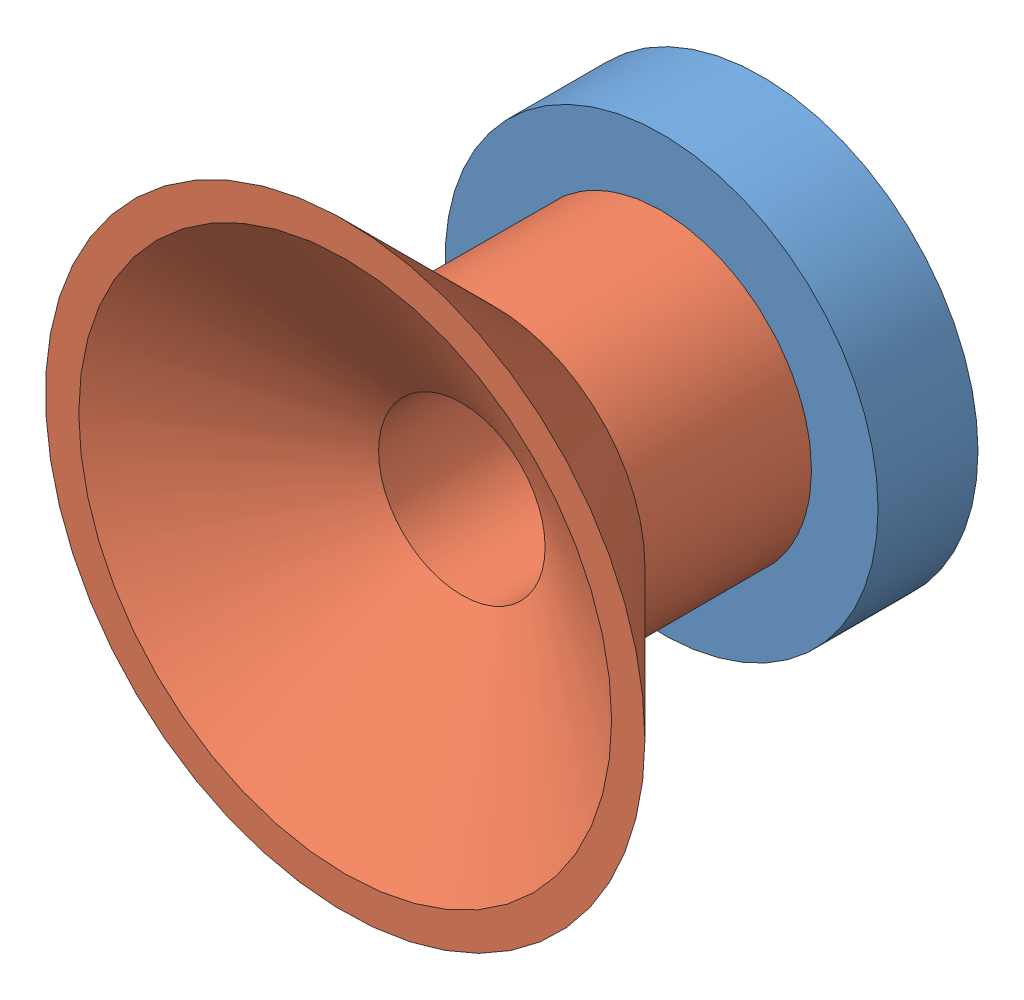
SolidWorks assembly 装配体1.sldasm, configuration 默认 (file format 9000). Lengths in mm.
Overall size (18 18 12.5).
2 component instances, 2 part files, 2 mates.
Components (placement in the parent):
- 铁环-1: 铁环.SLDPRT [默认] at (-3.7515 1.1438 14.5) size (13 13 3)
- 吸盘-1: 吸盘.SLDPRT [默认] at (-3.7515 1.1438 24) size (18 18 12.5)
Mates (geometry in assembly coordinates):
- 重合1: coincident: plane of 铁环-1 through (-8.2515 1.1438 11.5) normal (0 0 -1); plane of 吸盘-1 through (-8.8479 -4.4095 11.5) normal (0 0 -1)
- 同心1: concentric aligned: circle of 铁环-1; circle of 吸盘-1
